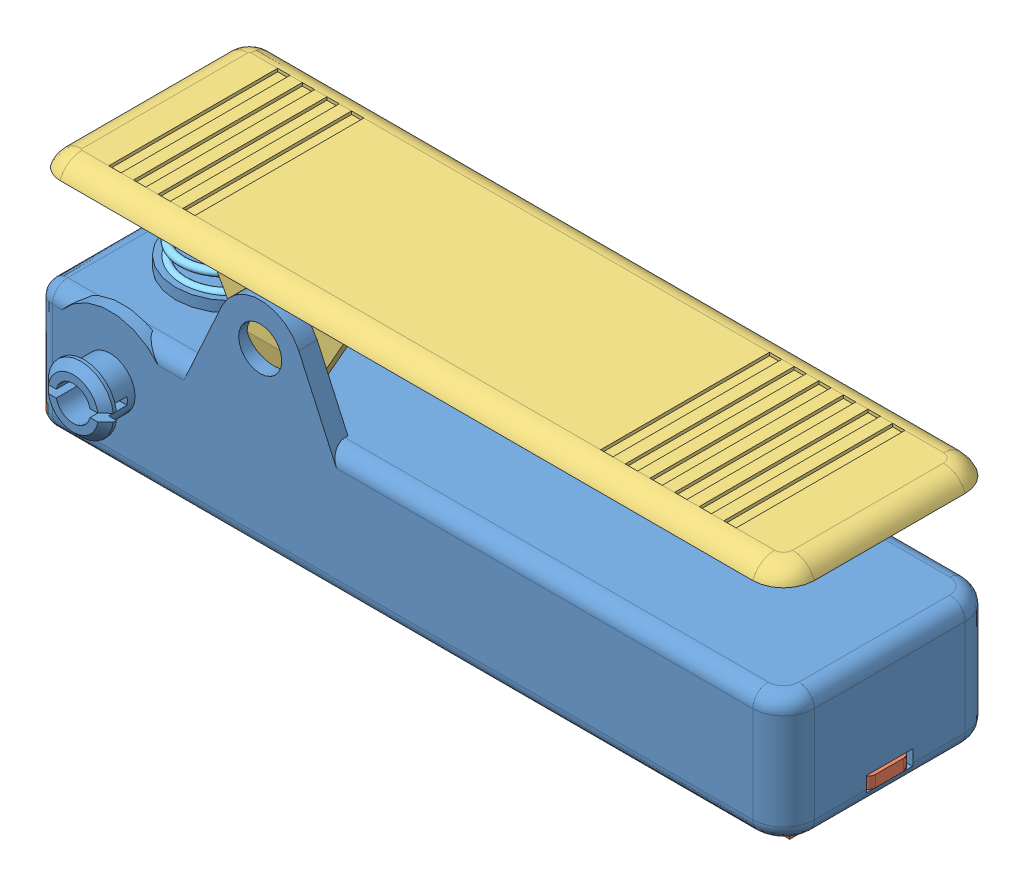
SolidWorks assembly Base Assembly.SLDASM, configuration Default (file format 3100). Lengths in mm.
Overall size (123.19 39.47 41.15).
8 component instances, 5 part files, 18 mates.
Components (placement in the parent):
- Base-1: Base.SLDPRT [Default] x (1 0 0) z (0 0 -1) size (123.19 36.4 41.15)
- Cover-1: Cover.SLDPRT [Default] at (0 -18.923 32.4358) x (-1 0 0) z (0 0 1) size (123.14 3.94 34.73)
- Clamp-1: Clamp.SLDPRT [Default] at (0 15.7734 35.052) size (123.19 17.04 35.05)
- battery-1: battery.SLDPRT [Default] at (115.951 -10.287 25.146) x (-1 0 0) z (0 0 1) size (49.71 14.48 14.22)
- battery-3: battery.SLDPRT [Default] at (68.7832 -10.287 9.906) x (1 0 0) z (0 0 -1) size (49.71 14.48 14.22)
- battery-4: battery.SLDPRT [Default] at (19.0754 -10.287 9.906) x (1 0 0) z (0 0 -1) size (49.71 14.48 14.22)
- battery-2: battery.SLDPRT [Default] at (66.2432 -10.287 25.146) x (-1 0 0) z (0 0 1) size (49.71 14.48 14.22)
- Spring-1: Spring.SLDPRT [Default] at (14.605 15.14 17.526) x (1 0 0) z (0 1 0) size (16.54 16.51 17.05)
Mates (geometry in assembly coordinates):
- Coincident4: coincident aligned: plane of Base-1; plane of Cover-1
- Coincident5: coincident aligned: plane of Base-1; plane of Cover-1
- Coincident6: coincident: line of Base-1; plane of Cover-1
- Concentric3: concentric anti-aligned: cylinder of Base-1; cylinder of Clamp-1
- Coincident10: coincident anti-aligned: plane of Base-1; plane of Clamp-1
- Tangent3: tangent anti-aligned: plane of Base-1; cylinder of battery-3
- Parallel1: parallel aligned: plane of Base-1; plane of battery-3
- Distance1: distance = 3.175 mm anti-aligned: plane of Base-1; plane of battery-3
- Parallel4: parallel aligned: plane of Base-1; plane of battery-1
- Coincident15: coincident aligned: plane of battery-1; plane of battery-3
- Tangent7: tangent anti-aligned: plane of Base-1; cylinder of battery-1
- Coincident16: coincident: axis of battery-1; plane of battery-3
- Coincident17: coincident anti-aligned: plane of Base-1; plane of assembly
- Coincident18: coincident anti-aligned: plane of Base-1; plane of assembly
- Coincident19: coincident aligned: plane of Base-1; plane of assembly
- Coincident20: coincident anti-aligned: axis of Base-1; line of Spring-1
- Coincident21: coincident aligned: plane of Base-1; plane of Spring-1
- Tangent8: tangent anti-aligned: plane of Base-1; cylinder of battery-3
